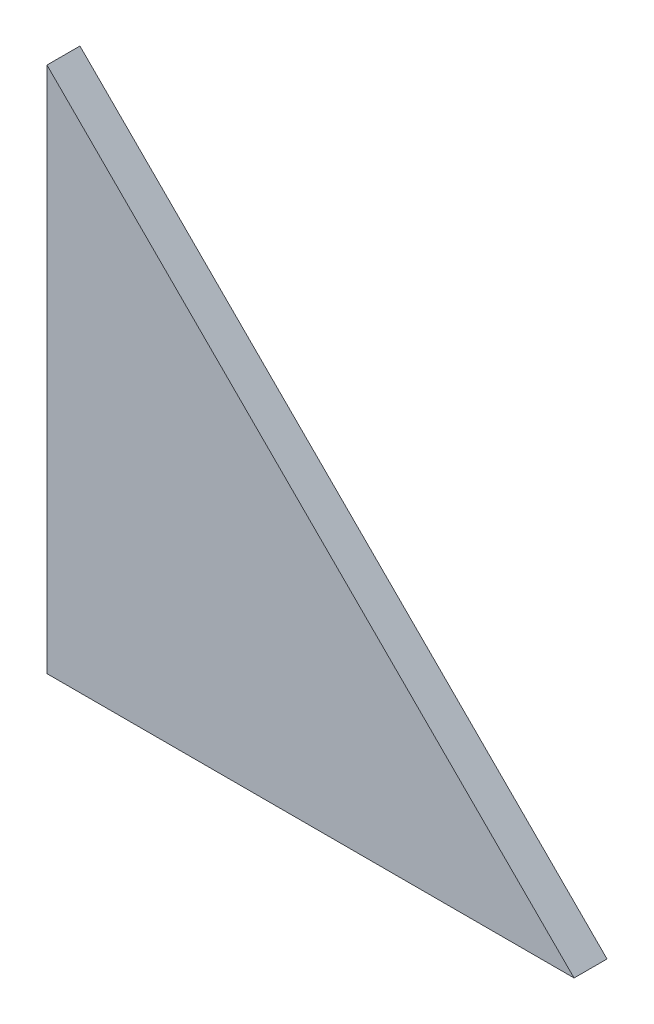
from build123d import *

# Parameters (mm, degrees)
BOSS_EXTRUDE1_DEPTH = 6.35


with BuildPart() as part:
    # Sketch1 → Boss-Extrude1 (new body)
    with BuildSketch(Plane.XY):
        Polygon((0, 0), (101.6, 0), (0, 101.6), align=None)
    extrude(amount=BOSS_EXTRUDE1_DEPTH)


solid = part.part
